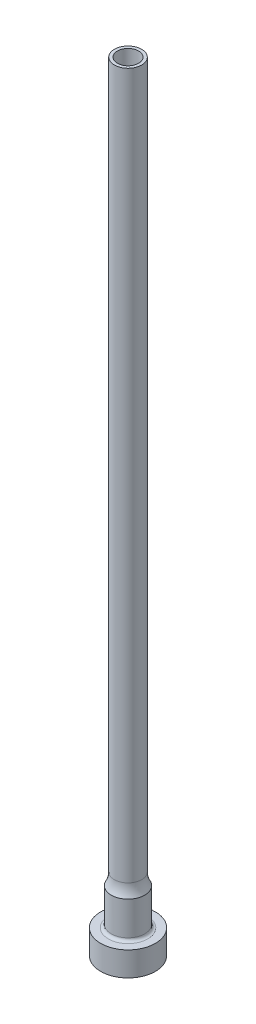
ISO-10303-21;
HEADER;
FILE_DESCRIPTION(('STEP AP214'),'2;1');
FILE_NAME('part.step','',(''),(''),'','','');
FILE_SCHEMA(('AUTOMOTIVE_DESIGN { 1 0 10303 214 1 1 1 1 }'));
ENDSEC;
DATA;
#1=APPLICATION_CONTEXT('core data for automotive mechanical design processes');
#2=APPLICATION_PROTOCOL_DEFINITION('international standard','automotive_design',2000,#1);
#3=PRODUCT_CONTEXT('',#1,'mechanical');
#4=PRODUCT('Part','Part','',(#3));
#5=PRODUCT_RELATED_PRODUCT_CATEGORY('part','',(#4));
#6=PRODUCT_DEFINITION_FORMATION('','',#4);
#7=PRODUCT_DEFINITION_CONTEXT('part definition',#1,'design');
#8=PRODUCT_DEFINITION('design','',#6,#7);
#9=PRODUCT_DEFINITION_SHAPE('','',#8);
#10=(LENGTH_UNIT() NAMED_UNIT(*) SI_UNIT(.MILLI.,.METRE.));
#11=(NAMED_UNIT(*) PLANE_ANGLE_UNIT() SI_UNIT($,.RADIAN.));
#12=(NAMED_UNIT(*) SI_UNIT($,.STERADIAN.) SOLID_ANGLE_UNIT());
#13=UNCERTAINTY_MEASURE_WITH_UNIT(LENGTH_MEASURE(1.E-05),#10,'distance_accuracy_value','');
#14=(GEOMETRIC_REPRESENTATION_CONTEXT(3) GLOBAL_UNCERTAINTY_ASSIGNED_CONTEXT((#13)) GLOBAL_UNIT_ASSIGNED_CONTEXT((#10,
#11,#12)) REPRESENTATION_CONTEXT('',''));
#15=CARTESIAN_POINT('',(0.,0.,0.));
#16=DIRECTION('',(0.,0.,1.));
#17=DIRECTION('',(1.,0.,0.));
#18=AXIS2_PLACEMENT_3D('',#15,#16,#17);
#19=CARTESIAN_POINT('',(0.,0.,0.));
#20=DIRECTION('',(0.,-1.,0.));
#21=DIRECTION('',(0.,0.,-1.));
#22=AXIS2_PLACEMENT_3D('',#19,#20,#21);
#23=CYLINDRICAL_SURFACE('',#22,7.1374);
#24=CARTESIAN_POINT('',(0.,6.35,0.));
#25=DIRECTION('',(0.,-1.,0.));
#26=DIRECTION('',(0.,0.,-1.));
#27=AXIS2_PLACEMENT_3D('',#24,#25,#26);
#28=CIRCLE('',#27,7.1374);
#29=CARTESIAN_POINT('',(0.,6.35,-7.1374));
#30=VERTEX_POINT('',#29);
#31=EDGE_CURVE('E42',#30,#30,#28,.T.);
#32=ORIENTED_EDGE('',*,*,#31,.T.);
#33=EDGE_LOOP('',(#32));
#34=FACE_BOUND('',#33,.T.);
#35=CARTESIAN_POINT('',(0.,0.,0.));
#36=DIRECTION('',(0.,-1.,0.));
#37=DIRECTION('',(0.,0.,-1.));
#38=AXIS2_PLACEMENT_3D('',#35,#36,#37);
#39=CIRCLE('',#38,7.1374);
#40=CARTESIAN_POINT('',(0.,0.,-7.1374));
#41=VERTEX_POINT('',#40);
#42=EDGE_CURVE('E69',#41,#41,#39,.T.);
#43=ORIENTED_EDGE('',*,*,#42,.F.);
#44=EDGE_LOOP('',(#43));
#45=FACE_BOUND('',#44,.T.);
#46=ADVANCED_FACE('F31',(#34,#45),#23,.T.);
#47=CARTESIAN_POINT('',(7.1374,6.35,0.));
#48=DIRECTION('',(0.,1.,0.));
#49=DIRECTION('',(0.,0.,1.));
#50=AXIS2_PLACEMENT_3D('',#47,#48,#49);
#51=PLANE('',#50);
#52=CARTESIAN_POINT('',(0.,6.35,0.));
#53=DIRECTION('',(0.,1.,0.));
#54=DIRECTION('',(0.,0.,1.));
#55=AXIS2_PLACEMENT_3D('',#52,#53,#54);
#56=CIRCLE('',#55,5.1308);
#57=CARTESIAN_POINT('',(0.,6.35,5.1308));
#58=VERTEX_POINT('',#57);
#59=EDGE_CURVE('E38',#58,#58,#56,.F.);
#60=ORIENTED_EDGE('',*,*,#59,.T.);
#61=EDGE_LOOP('',(#60));
#62=FACE_BOUND('',#61,.T.);
#63=ORIENTED_EDGE('',*,*,#31,.F.);
#64=EDGE_LOOP('',(#63));
#65=FACE_BOUND('',#64,.T.);
#66=ADVANCED_FACE('F77',(#62,#65),#51,.T.);
#67=CARTESIAN_POINT('',(0.,0.,0.));
#68=DIRECTION('',(0.,-1.,0.));
#69=DIRECTION('',(0.,0.,-1.));
#70=AXIS2_PLACEMENT_3D('',#67,#68,#69);
#71=CYLINDRICAL_SURFACE('',#70,4.3688);
#72=CARTESIAN_POINT('',(0.,7.112,0.));
#73=DIRECTION('',(0.,1.,0.));
#74=DIRECTION('',(0.,0.,1.));
#75=AXIS2_PLACEMENT_3D('',#72,#73,#74);
#76=CIRCLE('',#75,4.3688);
#77=CARTESIAN_POINT('',(0.,7.112,4.3688));
#78=VERTEX_POINT('',#77);
#79=EDGE_CURVE('E10',#78,#78,#76,.T.);
#80=ORIENTED_EDGE('',*,*,#79,.T.);
#81=EDGE_LOOP('',(#80));
#82=FACE_BOUND('',#81,.T.);
#83=CARTESIAN_POINT('',(0.,15.875,0.));
#84=DIRECTION('',(0.,-1.,0.));
#85=DIRECTION('',(0.,0.,-1.));
#86=AXIS2_PLACEMENT_3D('',#83,#84,#85);
#87=CIRCLE('',#86,4.3688);
#88=CARTESIAN_POINT('',(0.,15.875,-4.3688));
#89=VERTEX_POINT('',#88);
#90=EDGE_CURVE('E46',#89,#89,#87,.T.);
#91=ORIENTED_EDGE('',*,*,#90,.T.);
#92=EDGE_LOOP('',(#91));
#93=FACE_BOUND('',#92,.T.);
#94=ADVANCED_FACE('F82',(#82,#93),#71,.T.);
#95=CARTESIAN_POINT('',(0.,18.9674724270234,0.));
#96=DIRECTION('',(0.,-1.,0.));
#97=DIRECTION('',(0.,0.,-1.));
#98=AXIS2_PLACEMENT_3D('',#95,#96,#97);
#99=TOROIDAL_SURFACE('',#98,9.91489,6.35);
#100=CARTESIAN_POINT('',(0.,18.9674724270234,0.));
#101=DIRECTION('',(0.,-1.,0.));
#102=DIRECTION('',(0.,0.,-1.));
#103=AXIS2_PLACEMENT_3D('',#100,#101,#102);
#104=CIRCLE('',#103,3.56489);
#105=CARTESIAN_POINT('',(0.,18.9674724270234,-3.56489));
#106=VERTEX_POINT('',#105);
#107=EDGE_CURVE('E51',#106,#106,#104,.T.);
#108=ORIENTED_EDGE('',*,*,#107,.T.);
#109=EDGE_LOOP('',(#108));
#110=FACE_BOUND('',#109,.T.);
#111=ORIENTED_EDGE('',*,*,#90,.F.);
#112=EDGE_LOOP('',(#111));
#113=FACE_BOUND('',#112,.T.);
#114=ADVANCED_FACE('F87',(#110,#113),#99,.F.);
#115=CARTESIAN_POINT('',(0.,0.,0.));
#116=DIRECTION('',(0.,-1.,0.));
#117=DIRECTION('',(0.,0.,-1.));
#118=AXIS2_PLACEMENT_3D('',#115,#116,#117);
#119=CYLINDRICAL_SURFACE('',#118,3.56489);
#120=CARTESIAN_POINT('',(0.,203.2,0.));
#121=DIRECTION('',(0.,-1.,0.));
#122=DIRECTION('',(0.,0.,-1.));
#123=AXIS2_PLACEMENT_3D('',#120,#121,#122);
#124=CIRCLE('',#123,3.56489);
#125=CARTESIAN_POINT('',(0.,203.2,-3.56489));
#126=VERTEX_POINT('',#125);
#127=EDGE_CURVE('E54',#126,#126,#124,.T.);
#128=ORIENTED_EDGE('',*,*,#127,.T.);
#129=EDGE_LOOP('',(#128));
#130=FACE_BOUND('',#129,.T.);
#131=ORIENTED_EDGE('',*,*,#107,.F.);
#132=EDGE_LOOP('',(#131));
#133=FACE_BOUND('',#132,.T.);
#134=ADVANCED_FACE('F90',(#130,#133),#119,.T.);
#135=CARTESIAN_POINT('',(3.56489,203.2,0.));
#136=DIRECTION('',(0.,1.,0.));
#137=DIRECTION('',(0.,0.,1.));
#138=AXIS2_PLACEMENT_3D('',#135,#136,#137);
#139=PLANE('',#138);
#140=CARTESIAN_POINT('',(0.,203.2,0.));
#141=DIRECTION('',(0.,-1.,0.));
#142=DIRECTION('',(0.,0.,-1.));
#143=AXIS2_PLACEMENT_3D('',#140,#141,#142);
#144=CIRCLE('',#143,2.77748999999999);
#145=CARTESIAN_POINT('',(0.,203.2,-2.77748999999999));
#146=VERTEX_POINT('',#145);
#147=EDGE_CURVE('E57',#146,#146,#144,.T.);
#148=ORIENTED_EDGE('',*,*,#147,.T.);
#149=EDGE_LOOP('',(#148));
#150=FACE_BOUND('',#149,.T.);
#151=ORIENTED_EDGE('',*,*,#127,.F.);
#152=EDGE_LOOP('',(#151));
#153=FACE_BOUND('',#152,.T.);
#154=ADVANCED_FACE('F94',(#150,#153),#139,.T.);
#155=CARTESIAN_POINT('',(0.,0.,0.));
#156=DIRECTION('',(0.,-1.,0.));
#157=DIRECTION('',(0.,0.,-1.));
#158=AXIS2_PLACEMENT_3D('',#155,#156,#157);
#159=CYLINDRICAL_SURFACE('',#158,2.77749);
#160=CARTESIAN_POINT('',(0.,139.7,0.));
#161=DIRECTION('',(0.,-1.,0.));
#162=DIRECTION('',(0.,0.,-1.));
#163=AXIS2_PLACEMENT_3D('',#160,#161,#162);
#164=CIRCLE('',#163,2.77749);
#165=CARTESIAN_POINT('',(0.,139.7,-2.77749));
#166=VERTEX_POINT('',#165);
#167=EDGE_CURVE('E60',#166,#166,#164,.T.);
#168=ORIENTED_EDGE('',*,*,#167,.T.);
#169=EDGE_LOOP('',(#168));
#170=FACE_BOUND('',#169,.T.);
#171=ORIENTED_EDGE('',*,*,#147,.F.);
#172=EDGE_LOOP('',(#171));
#173=FACE_BOUND('',#172,.T.);
#174=ADVANCED_FACE('F98',(#170,#173),#159,.F.);
#175=CARTESIAN_POINT('',(0.,139.7,0.));
#176=DIRECTION('',(0.,-1.,0.));
#177=DIRECTION('',(0.,0.,-1.));
#178=AXIS2_PLACEMENT_3D('',#175,#176,#177);
#179=CONICAL_SURFACE('',#178,2.77749,1.04719755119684);
#180=CARTESIAN_POINT('',(0.,139.626676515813,0.));
#181=DIRECTION('',(0.,-1.,0.));
#182=DIRECTION('',(0.,0.,-1.));
#183=AXIS2_PLACEMENT_3D('',#180,#181,#182);
#184=CIRCLE('',#183,2.90448999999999);
#185=CARTESIAN_POINT('',(0.,139.626676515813,-2.90448999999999));
#186=VERTEX_POINT('',#185);
#187=EDGE_CURVE('E63',#186,#186,#184,.T.);
#188=ORIENTED_EDGE('',*,*,#187,.T.);
#189=EDGE_LOOP('',(#188));
#190=FACE_BOUND('',#189,.T.);
#191=ORIENTED_EDGE('',*,*,#167,.F.);
#192=EDGE_LOOP('',(#191));
#193=FACE_BOUND('',#192,.T.);
#194=ADVANCED_FACE('F102',(#190,#193),#179,.F.);
#195=CARTESIAN_POINT('',(0.,0.,0.));
#196=DIRECTION('',(0.,-1.,0.));
#197=DIRECTION('',(0.,0.,-1.));
#198=AXIS2_PLACEMENT_3D('',#195,#196,#197);
#199=CYLINDRICAL_SURFACE('',#198,2.90449);
#200=CARTESIAN_POINT('',(0.,0.,0.));
#201=DIRECTION('',(0.,-1.,0.));
#202=DIRECTION('',(0.,0.,-1.));
#203=AXIS2_PLACEMENT_3D('',#200,#201,#202);
#204=CIRCLE('',#203,2.90449);
#205=CARTESIAN_POINT('',(0.,0.,-2.90449));
#206=VERTEX_POINT('',#205);
#207=EDGE_CURVE('E66',#206,#206,#204,.T.);
#208=ORIENTED_EDGE('',*,*,#207,.T.);
#209=EDGE_LOOP('',(#208));
#210=FACE_BOUND('',#209,.T.);
#211=ORIENTED_EDGE('',*,*,#187,.F.);
#212=EDGE_LOOP('',(#211));
#213=FACE_BOUND('',#212,.T.);
#214=ADVANCED_FACE('F106',(#210,#213),#199,.F.);
#215=CARTESIAN_POINT('',(2.90449,0.,0.));
#216=DIRECTION('',(0.,-1.,0.));
#217=DIRECTION('',(0.,0.,-1.));
#218=AXIS2_PLACEMENT_3D('',#215,#216,#217);
#219=PLANE('',#218);
#220=ORIENTED_EDGE('',*,*,#42,.T.);
#221=EDGE_LOOP('',(#220));
#222=FACE_BOUND('',#221,.T.);
#223=ORIENTED_EDGE('',*,*,#207,.F.);
#224=EDGE_LOOP('',(#223));
#225=FACE_BOUND('',#224,.T.);
#226=ADVANCED_FACE('F73',(#222,#225),#219,.T.);
#227=CARTESIAN_POINT('',(0.,7.112,0.));
#228=DIRECTION('',(0.,1.,0.));
#229=DIRECTION('',(0.,0.,1.));
#230=AXIS2_PLACEMENT_3D('',#227,#228,#229);
#231=TOROIDAL_SURFACE('',#230,5.1308,0.762);
#232=ORIENTED_EDGE('',*,*,#79,.F.);
#233=EDGE_LOOP('',(#232));
#234=FACE_BOUND('',#233,.T.);
#235=ORIENTED_EDGE('',*,*,#59,.F.);
#236=EDGE_LOOP('',(#235));
#237=FACE_BOUND('',#236,.T.);
#238=ADVANCED_FACE('F33',(#234,#237),#231,.F.);
#239=CLOSED_SHELL('',(#46,#66,#94,#114,#134,#154,#174,#194,#214,#226,#238));
#240=MANIFOLD_SOLID_BREP('B2',#239);
#241=ADVANCED_BREP_SHAPE_REPRESENTATION('',(#18,#240),#14);
#242=SHAPE_DEFINITION_REPRESENTATION(#9,#241);
ENDSEC;
END-ISO-10303-21;
